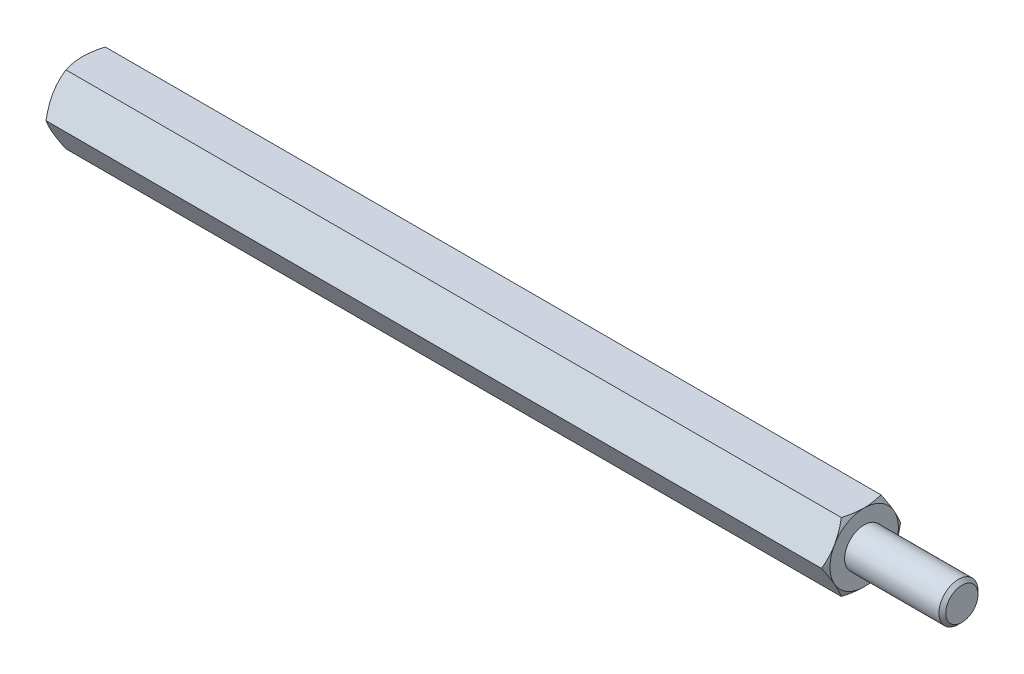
from build123d import *

# Parameters (mm, degrees)
EXTRUDE2_DEPTH = 40
SKETCH3_R      = 1.65
EXTRUDE3_DEPTH = 10
SKETCH5_R      = 2
EXTRUDE4_DEPTH = 10
CHAMFER1_SIZE  = 0.35


with BuildPart() as part:
    # Sketch1 → Extrude2 (new, symmetric)
    with BuildSketch(Plane(origin=(0, 0, 0), x_dir=(0, 0, -1), z_dir=(1, 0, 0))):
        Polygon((2.020725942, 3.5), (-2.020725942, 3.5), (-4.041451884, 0), (-2.020725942, -3.5), (2.020725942, -3.5), (4.041451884, 0), align=None)
    extrude(amount=EXTRUDE2_DEPTH, both=True)

    # Sketch2 → Cut-Revolve1 (revolve, cut)
    with BuildSketch(Plane.XY):
        with BuildLine():
            Line((-40, 3.5), (-38.5, 6.098076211))
            ThreePointArc((-38.5, 6.098076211), (-38.98810136, 7.276457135), (-40, 6.5))
            Line((-40, 6.5), (-40, 3.5))
        make_face()
    cut_revolve1 = revolve(axis=Axis((0, 0, 0), (1, 0, 0)), mode=Mode.SUBTRACT)

    # Mirror1: Cut-Revolve1 across plane
    add(cut_revolve1.mirror(Plane(origin=(0, 0, 0), x_dir=(0, 0, 1), z_dir=(1, 0, 0))), mode=Mode.SUBTRACT)

    # Sketch3 → Extrude3 (cut)
    with BuildSketch(Plane.ZY.offset(40)):
        Circle(SKETCH3_R)
    extrude(amount=-EXTRUDE3_DEPTH, mode=Mode.SUBTRACT)

    # Sketch4 → Cut-Revolve2 (revolve, cut)
    with BuildSketch(Plane.XY, mode=Mode.PRIVATE) as cut_revolve2_sk:
        Polygon((-30, 0), (-30, 1.65), (-29.047372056, 0), align=None)
    revolve(cut_revolve2_sk.sketch.rotate(Axis((-29.047372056, 0, 0), (-1, 0, 0)), 270), axis=Axis((-29.047372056, 0, 0), (-1, 0, 0)), mode=Mode.SUBTRACT)

    # Sketch5 → Extrude4 (add)
    with BuildSketch(Plane(origin=(40, 0, 0), x_dir=(0, 0, -1), z_dir=(1, 0, 0))):
        Circle(SKETCH5_R)
    extrude(amount=EXTRUDE4_DEPTH)

    # Chamfer1
    chamfer1_edges = [part.edges().sort_by_distance(p)[0] for p in [
        (50, 0, 2),
    ]]
    chamfer(chamfer1_edges, length=CHAMFER1_SIZE)


solid = part.part
